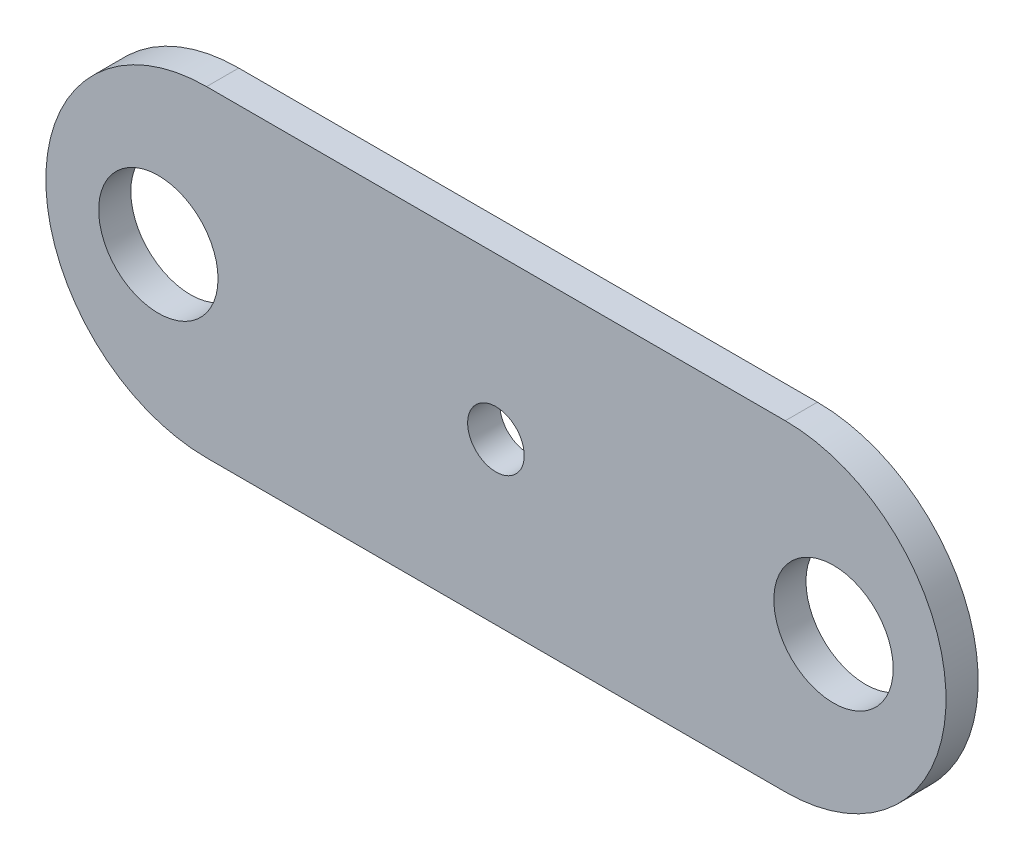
from build123d import *

# Parameters (mm, degrees)
EXTRUDE1_DEPTH                  = 0.396875
F_32_0_116_DIAMETER_HOLE1_D     = 2.9464
F_32_0_116_DIAMETER_HOLE1_DEPTH = 6.35
F_32_0_116_DIAMETER_HOLE1_TIP   = 0.885187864
F_54_0_055_DIAMETER_HOLE2_D     = 1.397


with BuildPart() as part:
    # Sketch1 → Extrude1 (new, symmetric)
    with BuildSketch(Plane.XY):
        with BuildLine():
            Line((-7.14375, -3.96875), (7.14375, -3.96875))
            ThreePointArc((7.14375, -3.96875), (11.1125, 0), (7.14375, 3.96875))
            Line((7.14375, 3.96875), (-7.14375, 3.96875))
            ThreePointArc((-7.14375, 3.96875), (-11.1125, 0), (-7.14375, -3.96875))
        make_face()
    extrude(amount=EXTRUDE1_DEPTH, both=True)

    # 32 _0.116_ Diameter Hole1
    with Locations(Plane.XY.offset(0.396875)):
        with Locations((-8.334375, 0), (8.334375, 0)):
            Hole(F_32_0_116_DIAMETER_HOLE1_D / 2, depth=F_32_0_116_DIAMETER_HOLE1_DEPTH)
            with Locations((0, 0, -(F_32_0_116_DIAMETER_HOLE1_DEPTH + F_32_0_116_DIAMETER_HOLE1_TIP / 2))):  # 118° drill point
                Cone(0, F_32_0_116_DIAMETER_HOLE1_D / 2, F_32_0_116_DIAMETER_HOLE1_TIP, mode=Mode.SUBTRACT)

    # 54 _0.055_ Diameter Hole2 (through all)
    with Locations(Plane.XY.offset(0.396875)):
        with Locations((0, 0)):
            Hole(F_54_0_055_DIAMETER_HOLE2_D / 2)


solid = part.part
